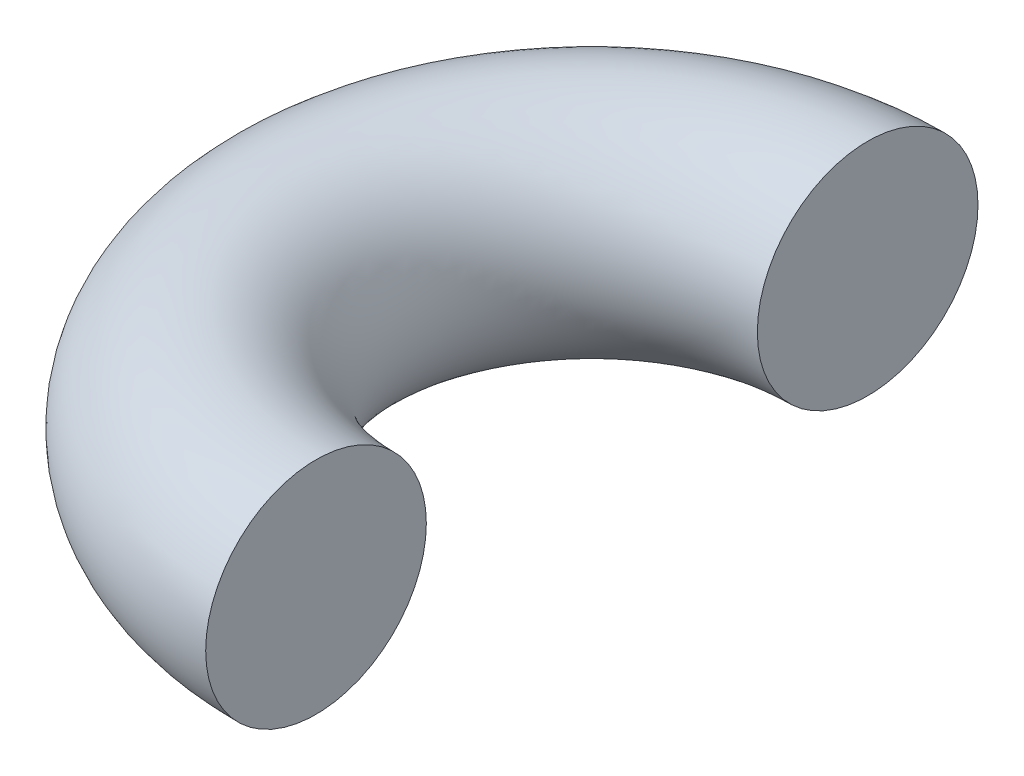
from build123d import *

# Parameters (mm, degrees)
SKETCH_4_R               = 20
CUT_EXTRUDE_1_DEPTH      = 101.995049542
CUT_EXTRUDE_1_DEPTH_BACK = 101.995049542


with BuildPart() as part:
    # Sweep 1: sweep along a path in Sketch 2
    with BuildLine(Plane(origin=(0, 0, 0), x_dir=(1, 0, 0), z_dir=(0, 1, 0))) as sweep_1_path:
        CenterArc((0, 0), 50, 0, 360)
    # Sketch 4 → Sweep 1 (sweep)
    with BuildSketch(Plane.XY):
        with Locations((50, 0)):
            Circle(SKETCH_4_R)
    sweep(path=sweep_1_path.line)

    # Sketch 5 → Cut-Extrude 1 (cut, two sides: drawn at the far end of the back side and taken through both)
    with BuildSketch(Plane(origin=(0, 0, 0), x_dir=(1, 0, 0), z_dir=(0, 1, 0)).offset(-CUT_EXTRUDE_1_DEPTH_BACK)):
        with BuildLine():
            Line((0, 70), (0, -70))
            ThreePointArc((0, -70), (70, 0), (0, 70))
        make_face()
    extrude(amount=CUT_EXTRUDE_1_DEPTH + CUT_EXTRUDE_1_DEPTH_BACK, mode=Mode.SUBTRACT)


solid = part.part
